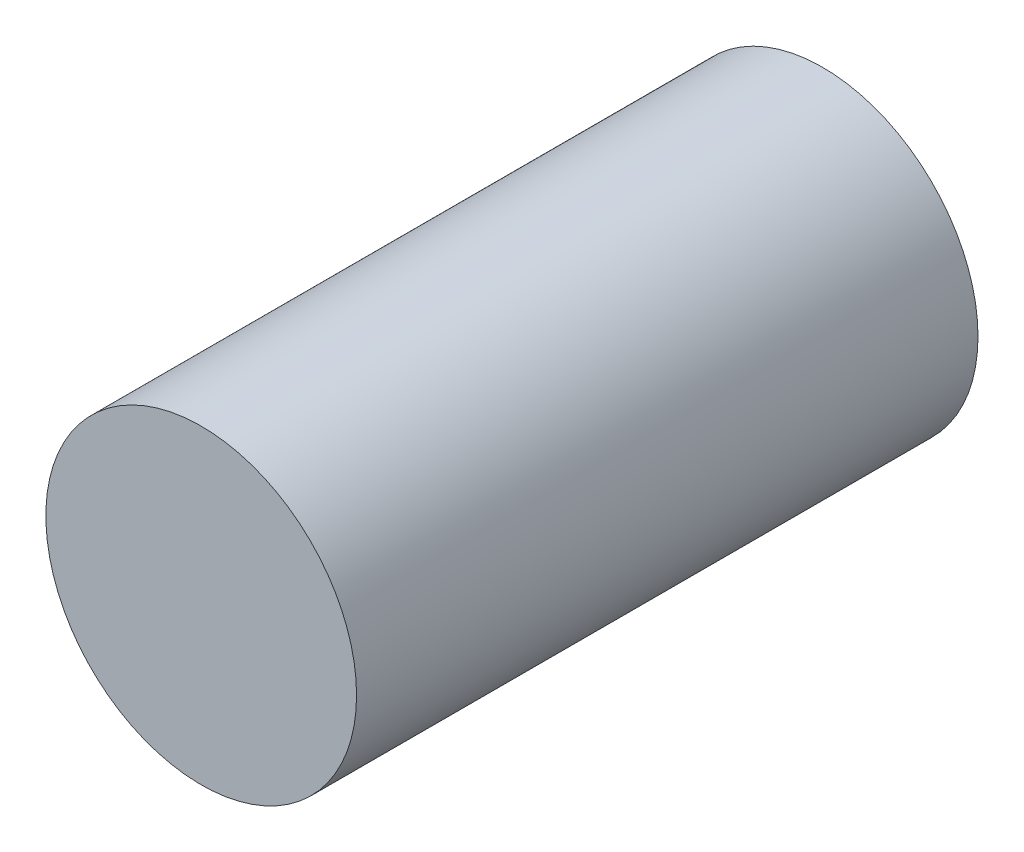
from build123d import *

# Parameters (mm, degrees)
ESQUISSE1_R          = 12.5
BASE_EXTRUSION_DEPTH = 50


with BuildPart() as part:
    # Esquisse1 → Base-Extrusion (new body)
    with BuildSketch(Plane.XY):
        Circle(ESQUISSE1_R)
    extrude(amount=BASE_EXTRUSION_DEPTH)


solid = part.part
